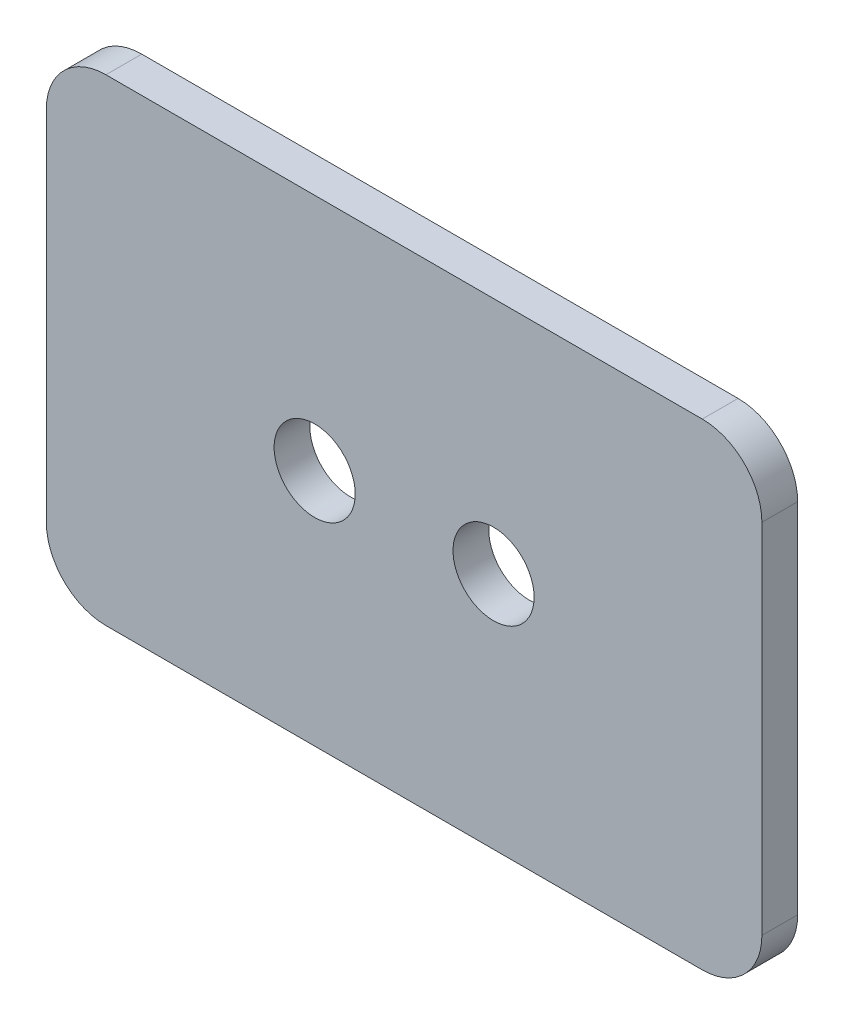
ISO-10303-21;
HEADER;
FILE_DESCRIPTION(('STEP AP214'),'2;1');
FILE_NAME('part.step','',(''),(''),'','','');
FILE_SCHEMA(('AUTOMOTIVE_DESIGN { 1 0 10303 214 1 1 1 1 }'));
ENDSEC;
DATA;
#1=APPLICATION_CONTEXT('core data for automotive mechanical design processes');
#2=APPLICATION_PROTOCOL_DEFINITION('international standard','automotive_design',2000,#1);
#3=PRODUCT_CONTEXT('',#1,'mechanical');
#4=PRODUCT('Part','Part','',(#3));
#5=PRODUCT_RELATED_PRODUCT_CATEGORY('part','',(#4));
#6=PRODUCT_DEFINITION_FORMATION('','',#4);
#7=PRODUCT_DEFINITION_CONTEXT('part definition',#1,'design');
#8=PRODUCT_DEFINITION('design','',#6,#7);
#9=PRODUCT_DEFINITION_SHAPE('','',#8);
#10=(LENGTH_UNIT() NAMED_UNIT(*) SI_UNIT(.MILLI.,.METRE.));
#11=(NAMED_UNIT(*) PLANE_ANGLE_UNIT() SI_UNIT($,.RADIAN.));
#12=(NAMED_UNIT(*) SI_UNIT($,.STERADIAN.) SOLID_ANGLE_UNIT());
#13=UNCERTAINTY_MEASURE_WITH_UNIT(LENGTH_MEASURE(1.E-05),#10,'distance_accuracy_value','');
#14=(GEOMETRIC_REPRESENTATION_CONTEXT(3) GLOBAL_UNCERTAINTY_ASSIGNED_CONTEXT((#13)) GLOBAL_UNIT_ASSIGNED_CONTEXT((#10,
#11,#12)) REPRESENTATION_CONTEXT('',''));
#15=CARTESIAN_POINT('',(0.,0.,0.));
#16=DIRECTION('',(0.,0.,1.));
#17=DIRECTION('',(1.,0.,0.));
#18=AXIS2_PLACEMENT_3D('',#15,#16,#17);
#19=CARTESIAN_POINT('',(0.,0.,3.));
#20=DIRECTION('',(1.,0.,0.));
#21=DIRECTION('',(0.,0.,-1.));
#22=AXIS2_PLACEMENT_3D('',#19,#20,#21);
#23=PLANE('',#22);
#24=DIRECTION('',(0.,-1.,0.));
#25=VECTOR('',#24,1.);
#26=CARTESIAN_POINT('',(0.,0.,0.));
#27=LINE('',#26,#25);
#28=CARTESIAN_POINT('',(0.,35.,0.));
#29=VERTEX_POINT('',#28);
#30=CARTESIAN_POINT('',(0.,5.,0.));
#31=VERTEX_POINT('',#30);
#32=EDGE_CURVE('E136',#29,#31,#27,.T.);
#33=ORIENTED_EDGE('',*,*,#32,.T.);
#34=DIRECTION('',(0.,0.,-1.));
#35=VECTOR('',#34,1.);
#36=CARTESIAN_POINT('',(0.,5.,3.));
#37=LINE('',#36,#35);
#38=CARTESIAN_POINT('',(0.,5.,3.));
#39=VERTEX_POINT('',#38);
#40=EDGE_CURVE('E11',#31,#39,#37,.F.);
#41=ORIENTED_EDGE('',*,*,#40,.T.);
#42=DIRECTION('',(0.,-1.,0.));
#43=VECTOR('',#42,1.);
#44=CARTESIAN_POINT('',(0.,0.,3.));
#45=LINE('',#44,#43);
#46=CARTESIAN_POINT('',(0.,35.,3.));
#47=VERTEX_POINT('',#46);
#48=EDGE_CURVE('E124',#47,#39,#45,.T.);
#49=ORIENTED_EDGE('',*,*,#48,.F.);
#50=DIRECTION('',(0.,0.,-1.));
#51=VECTOR('',#50,1.);
#52=CARTESIAN_POINT('',(0.,35.,3.));
#53=LINE('',#52,#51);
#54=EDGE_CURVE('E40',#47,#29,#53,.T.);
#55=ORIENTED_EDGE('',*,*,#54,.T.);
#56=EDGE_LOOP('',(#33,#41,#49,#55));
#57=FACE_BOUND('',#56,.T.);
#58=ADVANCED_FACE('F32',(#57),#23,.F.);
#59=CARTESIAN_POINT('',(0.,0.,3.));
#60=DIRECTION('',(0.,1.,0.));
#61=DIRECTION('',(0.,0.,1.));
#62=AXIS2_PLACEMENT_3D('',#59,#60,#61);
#63=PLANE('',#62);
#64=DIRECTION('',(1.,0.,0.));
#65=VECTOR('',#64,1.);
#66=CARTESIAN_POINT('',(0.,0.,0.));
#67=LINE('',#66,#65);
#68=CARTESIAN_POINT('',(5.,0.,0.));
#69=VERTEX_POINT('',#68);
#70=CARTESIAN_POINT('',(55.,0.,0.));
#71=VERTEX_POINT('',#70);
#72=EDGE_CURVE('E129',#69,#71,#67,.T.);
#73=ORIENTED_EDGE('',*,*,#72,.T.);
#74=DIRECTION('',(0.,0.,-1.));
#75=VECTOR('',#74,1.);
#76=CARTESIAN_POINT('',(55.,0.,3.));
#77=LINE('',#76,#75);
#78=CARTESIAN_POINT('',(55.,0.,3.));
#79=VERTEX_POINT('',#78);
#80=EDGE_CURVE('E47',#71,#79,#77,.F.);
#81=ORIENTED_EDGE('',*,*,#80,.T.);
#82=DIRECTION('',(1.,0.,0.));
#83=VECTOR('',#82,1.);
#84=CARTESIAN_POINT('',(0.,0.,3.));
#85=LINE('',#84,#83);
#86=CARTESIAN_POINT('',(5.,0.,3.));
#87=VERTEX_POINT('',#86);
#88=EDGE_CURVE('E127',#87,#79,#85,.T.);
#89=ORIENTED_EDGE('',*,*,#88,.F.);
#90=DIRECTION('',(0.,0.,-1.));
#91=VECTOR('',#90,1.);
#92=CARTESIAN_POINT('',(5.,0.,3.));
#93=LINE('',#92,#91);
#94=EDGE_CURVE('E157',#87,#69,#93,.T.);
#95=ORIENTED_EDGE('',*,*,#94,.T.);
#96=EDGE_LOOP('',(#73,#81,#89,#95));
#97=FACE_BOUND('',#96,.T.);
#98=ADVANCED_FACE('F195',(#97),#63,.F.);
#99=CARTESIAN_POINT('',(60.,0.,3.));
#100=DIRECTION('',(-1.,0.,0.));
#101=DIRECTION('',(0.,0.,1.));
#102=AXIS2_PLACEMENT_3D('',#99,#100,#101);
#103=PLANE('',#102);
#104=DIRECTION('',(0.,1.,0.));
#105=VECTOR('',#104,1.);
#106=CARTESIAN_POINT('',(60.,0.,0.));
#107=LINE('',#106,#105);
#108=CARTESIAN_POINT('',(60.,5.,0.));
#109=VERTEX_POINT('',#108);
#110=CARTESIAN_POINT('',(60.,35.,0.));
#111=VERTEX_POINT('',#110);
#112=EDGE_CURVE('E125',#109,#111,#107,.T.);
#113=ORIENTED_EDGE('',*,*,#112,.T.);
#114=DIRECTION('',(0.,0.,-1.));
#115=VECTOR('',#114,1.);
#116=CARTESIAN_POINT('',(60.,35.,3.));
#117=LINE('',#116,#115);
#118=CARTESIAN_POINT('',(60.,35.,3.));
#119=VERTEX_POINT('',#118);
#120=EDGE_CURVE('E103',#111,#119,#117,.F.);
#121=ORIENTED_EDGE('',*,*,#120,.T.);
#122=DIRECTION('',(0.,1.,0.));
#123=VECTOR('',#122,1.);
#124=CARTESIAN_POINT('',(60.,0.,3.));
#125=LINE('',#124,#123);
#126=CARTESIAN_POINT('',(60.,5.,3.));
#127=VERTEX_POINT('',#126);
#128=EDGE_CURVE('E172',#127,#119,#125,.T.);
#129=ORIENTED_EDGE('',*,*,#128,.F.);
#130=DIRECTION('',(0.,0.,-1.));
#131=VECTOR('',#130,1.);
#132=CARTESIAN_POINT('',(60.,5.,3.));
#133=LINE('',#132,#131);
#134=EDGE_CURVE('E108',#127,#109,#133,.T.);
#135=ORIENTED_EDGE('',*,*,#134,.T.);
#136=EDGE_LOOP('',(#113,#121,#129,#135));
#137=FACE_BOUND('',#136,.T.);
#138=ADVANCED_FACE('F192',(#137),#103,.F.);
#139=CARTESIAN_POINT('',(0.,40.,3.));
#140=DIRECTION('',(0.,-1.,0.));
#141=DIRECTION('',(0.,0.,-1.));
#142=AXIS2_PLACEMENT_3D('',#139,#140,#141);
#143=PLANE('',#142);
#144=DIRECTION('',(-1.,0.,0.));
#145=VECTOR('',#144,1.);
#146=CARTESIAN_POINT('',(0.,40.,3.));
#147=LINE('',#146,#145);
#148=CARTESIAN_POINT('',(55.,40.,3.));
#149=VERTEX_POINT('',#148);
#150=CARTESIAN_POINT('',(5.,40.,3.));
#151=VERTEX_POINT('',#150);
#152=EDGE_CURVE('E118',#149,#151,#147,.T.);
#153=ORIENTED_EDGE('',*,*,#152,.F.);
#154=DIRECTION('',(0.,0.,-1.));
#155=VECTOR('',#154,1.);
#156=CARTESIAN_POINT('',(55.,40.,3.));
#157=LINE('',#156,#155);
#158=CARTESIAN_POINT('',(55.,40.,0.));
#159=VERTEX_POINT('',#158);
#160=EDGE_CURVE('E102',#149,#159,#157,.T.);
#161=ORIENTED_EDGE('',*,*,#160,.T.);
#162=DIRECTION('',(-1.,0.,0.));
#163=VECTOR('',#162,1.);
#164=CARTESIAN_POINT('',(0.,40.,0.));
#165=LINE('',#164,#163);
#166=CARTESIAN_POINT('',(5.,40.,0.));
#167=VERTEX_POINT('',#166);
#168=EDGE_CURVE('E115',#159,#167,#165,.T.);
#169=ORIENTED_EDGE('',*,*,#168,.T.);
#170=DIRECTION('',(0.,0.,-1.));
#171=VECTOR('',#170,1.);
#172=CARTESIAN_POINT('',(5.,40.,3.));
#173=LINE('',#172,#171);
#174=EDGE_CURVE('E120',#167,#151,#173,.F.);
#175=ORIENTED_EDGE('',*,*,#174,.T.);
#176=EDGE_LOOP('',(#153,#161,#169,#175));
#177=FACE_BOUND('',#176,.T.);
#178=ADVANCED_FACE('F114',(#177),#143,.F.);
#179=CARTESIAN_POINT('',(0.,40.,3.));
#180=DIRECTION('',(0.,0.,-1.));
#181=DIRECTION('',(-1.,0.,0.));
#182=AXIS2_PLACEMENT_3D('',#179,#180,#181);
#183=PLANE('',#182);
#184=CARTESIAN_POINT('',(37.5,20.,3.));
#185=DIRECTION('',(0.,0.,1.));
#186=DIRECTION('',(1.,0.,0.));
#187=AXIS2_PLACEMENT_3D('',#184,#185,#186);
#188=CIRCLE('',#187,3.4);
#189=CARTESIAN_POINT('',(40.9,20.,3.));
#190=VERTEX_POINT('',#189);
#191=EDGE_CURVE('E141',#190,#190,#188,.T.);
#192=ORIENTED_EDGE('',*,*,#191,.F.);
#193=EDGE_LOOP('',(#192));
#194=FACE_BOUND('',#193,.T.);
#195=CARTESIAN_POINT('',(22.5,20.,3.));
#196=DIRECTION('',(0.,0.,1.));
#197=DIRECTION('',(1.,0.,0.));
#198=AXIS2_PLACEMENT_3D('',#195,#196,#197);
#199=CIRCLE('',#198,3.4);
#200=CARTESIAN_POINT('',(25.9,20.,3.));
#201=VERTEX_POINT('',#200);
#202=EDGE_CURVE('E137',#201,#201,#199,.T.);
#203=ORIENTED_EDGE('',*,*,#202,.F.);
#204=EDGE_LOOP('',(#203));
#205=FACE_BOUND('',#204,.T.);
#206=ORIENTED_EDGE('',*,*,#128,.T.);
#207=CARTESIAN_POINT('',(55.,35.,3.));
#208=DIRECTION('',(0.,0.,-1.));
#209=DIRECTION('',(-1.,0.,0.));
#210=AXIS2_PLACEMENT_3D('',#207,#208,#209);
#211=CIRCLE('',#210,5.);
#212=EDGE_CURVE('E155',#119,#149,#211,.F.);
#213=ORIENTED_EDGE('',*,*,#212,.T.);
#214=ORIENTED_EDGE('',*,*,#152,.T.);
#215=CARTESIAN_POINT('',(5.,35.,3.));
#216=DIRECTION('',(0.,0.,-1.));
#217=DIRECTION('',(-1.,0.,0.));
#218=AXIS2_PLACEMENT_3D('',#215,#216,#217);
#219=CIRCLE('',#218,5.);
#220=EDGE_CURVE('E150',#151,#47,#219,.F.);
#221=ORIENTED_EDGE('',*,*,#220,.T.);
#222=ORIENTED_EDGE('',*,*,#48,.T.);
#223=CARTESIAN_POINT('',(5.,5.,3.));
#224=DIRECTION('',(0.,0.,-1.));
#225=DIRECTION('',(-1.,0.,0.));
#226=AXIS2_PLACEMENT_3D('',#223,#224,#225);
#227=CIRCLE('',#226,5.);
#228=EDGE_CURVE('E54',#39,#87,#227,.F.);
#229=ORIENTED_EDGE('',*,*,#228,.T.);
#230=ORIENTED_EDGE('',*,*,#88,.T.);
#231=CARTESIAN_POINT('',(55.,5.,3.));
#232=DIRECTION('',(0.,0.,-1.));
#233=DIRECTION('',(-1.,0.,0.));
#234=AXIS2_PLACEMENT_3D('',#231,#232,#233);
#235=CIRCLE('',#234,5.);
#236=EDGE_CURVE('E153',#79,#127,#235,.F.);
#237=ORIENTED_EDGE('',*,*,#236,.T.);
#238=EDGE_LOOP('',(#206,#213,#214,#221,#222,#229,#230,#237));
#239=FACE_BOUND('',#238,.T.);
#240=ADVANCED_FACE('F183',(#194,#205,#239),#183,.F.);
#241=CARTESIAN_POINT('',(0.,40.,0.));
#242=DIRECTION('',(0.,0.,-1.));
#243=DIRECTION('',(-1.,0.,0.));
#244=AXIS2_PLACEMENT_3D('',#241,#242,#243);
#245=PLANE('',#244);
#246=CARTESIAN_POINT('',(37.5,20.,0.));
#247=DIRECTION('',(0.,0.,-1.));
#248=DIRECTION('',(-1.,0.,0.));
#249=AXIS2_PLACEMENT_3D('',#246,#247,#248);
#250=CIRCLE('',#249,3.4);
#251=CARTESIAN_POINT('',(34.1,20.,0.));
#252=VERTEX_POINT('',#251);
#253=EDGE_CURVE('E138',#252,#252,#250,.T.);
#254=ORIENTED_EDGE('',*,*,#253,.F.);
#255=EDGE_LOOP('',(#254));
#256=FACE_BOUND('',#255,.T.);
#257=CARTESIAN_POINT('',(22.5,20.,0.));
#258=DIRECTION('',(0.,0.,-1.));
#259=DIRECTION('',(-1.,0.,0.));
#260=AXIS2_PLACEMENT_3D('',#257,#258,#259);
#261=CIRCLE('',#260,3.4);
#262=CARTESIAN_POINT('',(19.1,20.,0.));
#263=VERTEX_POINT('',#262);
#264=EDGE_CURVE('E133',#263,#263,#261,.T.);
#265=ORIENTED_EDGE('',*,*,#264,.F.);
#266=EDGE_LOOP('',(#265));
#267=FACE_BOUND('',#266,.T.);
#268=ORIENTED_EDGE('',*,*,#168,.F.);
#269=CARTESIAN_POINT('',(55.,35.,0.));
#270=DIRECTION('',(0.,0.,-1.));
#271=DIRECTION('',(-1.,0.,0.));
#272=AXIS2_PLACEMENT_3D('',#269,#270,#271);
#273=CIRCLE('',#272,5.);
#274=EDGE_CURVE('E98',#159,#111,#273,.T.);
#275=ORIENTED_EDGE('',*,*,#274,.T.);
#276=ORIENTED_EDGE('',*,*,#112,.F.);
#277=CARTESIAN_POINT('',(55.,5.,0.));
#278=DIRECTION('',(0.,0.,-1.));
#279=DIRECTION('',(-1.,0.,0.));
#280=AXIS2_PLACEMENT_3D('',#277,#278,#279);
#281=CIRCLE('',#280,5.);
#282=EDGE_CURVE('E109',#109,#71,#281,.T.);
#283=ORIENTED_EDGE('',*,*,#282,.T.);
#284=ORIENTED_EDGE('',*,*,#72,.F.);
#285=CARTESIAN_POINT('',(5.,5.,0.));
#286=DIRECTION('',(0.,0.,-1.));
#287=DIRECTION('',(-1.,0.,0.));
#288=AXIS2_PLACEMENT_3D('',#285,#286,#287);
#289=CIRCLE('',#288,5.);
#290=EDGE_CURVE('E144',#69,#31,#289,.T.);
#291=ORIENTED_EDGE('',*,*,#290,.T.);
#292=ORIENTED_EDGE('',*,*,#32,.F.);
#293=CARTESIAN_POINT('',(5.,35.,0.));
#294=DIRECTION('',(0.,0.,-1.));
#295=DIRECTION('',(-1.,0.,0.));
#296=AXIS2_PLACEMENT_3D('',#293,#294,#295);
#297=CIRCLE('',#296,5.);
#298=EDGE_CURVE('E119',#29,#167,#297,.T.);
#299=ORIENTED_EDGE('',*,*,#298,.T.);
#300=EDGE_LOOP('',(#268,#275,#276,#283,#284,#291,#292,#299));
#301=FACE_BOUND('',#300,.T.);
#302=ADVANCED_FACE('F122',(#256,#267,#301),#245,.T.);
#303=CARTESIAN_POINT('',(22.5,20.,-1.));
#304=DIRECTION('',(0.,0.,1.));
#305=DIRECTION('',(1.,0.,0.));
#306=AXIS2_PLACEMENT_3D('',#303,#304,#305);
#307=CYLINDRICAL_SURFACE('',#306,3.4);
#308=ORIENTED_EDGE('',*,*,#264,.T.);
#309=EDGE_LOOP('',(#308));
#310=FACE_BOUND('',#309,.T.);
#311=ORIENTED_EDGE('',*,*,#202,.T.);
#312=EDGE_LOOP('',(#311));
#313=FACE_BOUND('',#312,.T.);
#314=ADVANCED_FACE('F243',(#310,#313),#307,.F.);
#315=CARTESIAN_POINT('',(37.5,20.,-1.));
#316=DIRECTION('',(0.,0.,1.));
#317=DIRECTION('',(1.,0.,0.));
#318=AXIS2_PLACEMENT_3D('',#315,#316,#317);
#319=CYLINDRICAL_SURFACE('',#318,3.4);
#320=ORIENTED_EDGE('',*,*,#253,.T.);
#321=EDGE_LOOP('',(#320));
#322=FACE_BOUND('',#321,.T.);
#323=ORIENTED_EDGE('',*,*,#191,.T.);
#324=EDGE_LOOP('',(#323));
#325=FACE_BOUND('',#324,.T.);
#326=ADVANCED_FACE('F181',(#322,#325),#319,.F.);
#327=CARTESIAN_POINT('',(55.,35.,3.));
#328=DIRECTION('',(0.,0.,-1.));
#329=DIRECTION('',(-1.,0.,0.));
#330=AXIS2_PLACEMENT_3D('',#327,#328,#329);
#331=CYLINDRICAL_SURFACE('',#330,5.);
#332=ORIENTED_EDGE('',*,*,#212,.F.);
#333=ORIENTED_EDGE('',*,*,#120,.F.);
#334=ORIENTED_EDGE('',*,*,#274,.F.);
#335=ORIENTED_EDGE('',*,*,#160,.F.);
#336=EDGE_LOOP('',(#332,#333,#334,#335));
#337=FACE_BOUND('',#336,.T.);
#338=ADVANCED_FACE('F101',(#337),#331,.T.);
#339=CARTESIAN_POINT('',(55.,5.,3.));
#340=DIRECTION('',(0.,0.,-1.));
#341=DIRECTION('',(-1.,0.,0.));
#342=AXIS2_PLACEMENT_3D('',#339,#340,#341);
#343=CYLINDRICAL_SURFACE('',#342,5.);
#344=ORIENTED_EDGE('',*,*,#236,.F.);
#345=ORIENTED_EDGE('',*,*,#80,.F.);
#346=ORIENTED_EDGE('',*,*,#282,.F.);
#347=ORIENTED_EDGE('',*,*,#134,.F.);
#348=EDGE_LOOP('',(#344,#345,#346,#347));
#349=FACE_BOUND('',#348,.T.);
#350=ADVANCED_FACE('F194',(#349),#343,.T.);
#351=CARTESIAN_POINT('',(5.,5.,3.));
#352=DIRECTION('',(0.,0.,-1.));
#353=DIRECTION('',(-1.,0.,0.));
#354=AXIS2_PLACEMENT_3D('',#351,#352,#353);
#355=CYLINDRICAL_SURFACE('',#354,5.);
#356=ORIENTED_EDGE('',*,*,#228,.F.);
#357=ORIENTED_EDGE('',*,*,#40,.F.);
#358=ORIENTED_EDGE('',*,*,#290,.F.);
#359=ORIENTED_EDGE('',*,*,#94,.F.);
#360=EDGE_LOOP('',(#356,#357,#358,#359));
#361=FACE_BOUND('',#360,.T.);
#362=ADVANCED_FACE('F198',(#361),#355,.T.);
#363=CARTESIAN_POINT('',(5.,35.,3.));
#364=DIRECTION('',(0.,0.,-1.));
#365=DIRECTION('',(-1.,0.,0.));
#366=AXIS2_PLACEMENT_3D('',#363,#364,#365);
#367=CYLINDRICAL_SURFACE('',#366,5.);
#368=ORIENTED_EDGE('',*,*,#220,.F.);
#369=ORIENTED_EDGE('',*,*,#174,.F.);
#370=ORIENTED_EDGE('',*,*,#298,.F.);
#371=ORIENTED_EDGE('',*,*,#54,.F.);
#372=EDGE_LOOP('',(#368,#369,#370,#371));
#373=FACE_BOUND('',#372,.T.);
#374=ADVANCED_FACE('F34',(#373),#367,.T.);
#375=CLOSED_SHELL('',(#58,#98,#138,#178,#240,#302,#314,#326,#338,#350,#362,#374));
#376=MANIFOLD_SOLID_BREP('B2',#375);
#377=ADVANCED_BREP_SHAPE_REPRESENTATION('',(#18,#376),#14);
#378=SHAPE_DEFINITION_REPRESENTATION(#9,#377);
ENDSEC;
END-ISO-10303-21;
